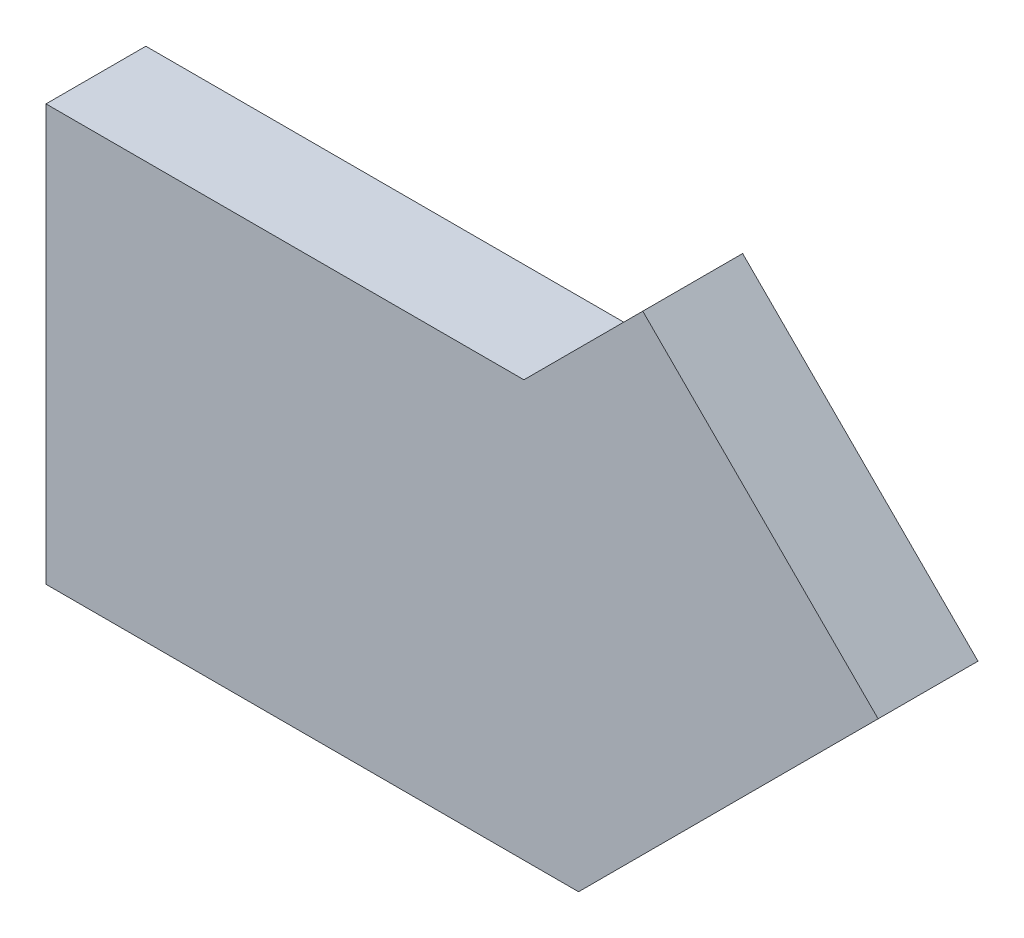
ISO-10303-21;
HEADER;
FILE_DESCRIPTION(('STEP AP214'),'2;1');
FILE_NAME('part.step','',(''),(''),'','','');
FILE_SCHEMA(('AUTOMOTIVE_DESIGN { 1 0 10303 214 1 1 1 1 }'));
ENDSEC;
DATA;
#1=APPLICATION_CONTEXT('core data for automotive mechanical design processes');
#2=APPLICATION_PROTOCOL_DEFINITION('international standard','automotive_design',2000,#1);
#3=PRODUCT_CONTEXT('',#1,'mechanical');
#4=PRODUCT('Part','Part','',(#3));
#5=PRODUCT_RELATED_PRODUCT_CATEGORY('part','',(#4));
#6=PRODUCT_DEFINITION_FORMATION('','',#4);
#7=PRODUCT_DEFINITION_CONTEXT('part definition',#1,'design');
#8=PRODUCT_DEFINITION('design','',#6,#7);
#9=PRODUCT_DEFINITION_SHAPE('','',#8);
#10=(LENGTH_UNIT() NAMED_UNIT(*) SI_UNIT(.MILLI.,.METRE.));
#11=(NAMED_UNIT(*) PLANE_ANGLE_UNIT() SI_UNIT($,.RADIAN.));
#12=(NAMED_UNIT(*) SI_UNIT($,.STERADIAN.) SOLID_ANGLE_UNIT());
#13=UNCERTAINTY_MEASURE_WITH_UNIT(LENGTH_MEASURE(1.E-05),#10,'distance_accuracy_value','');
#14=(GEOMETRIC_REPRESENTATION_CONTEXT(3) GLOBAL_UNCERTAINTY_ASSIGNED_CONTEXT((#13)) GLOBAL_UNIT_ASSIGNED_CONTEXT((#10,
#11,#12)) REPRESENTATION_CONTEXT('',''));
#15=CARTESIAN_POINT('',(0.,0.,0.));
#16=DIRECTION('',(0.,0.,1.));
#17=DIRECTION('',(1.,0.,0.));
#18=AXIS2_PLACEMENT_3D('',#15,#16,#17);
#19=CARTESIAN_POINT('',(0.,25.,6.));
#20=DIRECTION('',(1.,0.,0.));
#21=DIRECTION('',(0.,1.,0.));
#22=AXIS2_PLACEMENT_3D('',#19,#20,#21);
#23=PLANE('',#22);
#24=DIRECTION('',(0.,-1.,0.));
#25=VECTOR('',#24,1.);
#26=CARTESIAN_POINT('',(0.,25.,0.));
#27=LINE('',#26,#25);
#28=CARTESIAN_POINT('',(0.,25.,0.));
#29=VERTEX_POINT('',#28);
#30=CARTESIAN_POINT('',(0.,0.,0.));
#31=VERTEX_POINT('',#30);
#32=EDGE_CURVE('E124',#29,#31,#27,.T.);
#33=ORIENTED_EDGE('',*,*,#32,.T.);
#34=DIRECTION('',(0.,0.,-1.));
#35=VECTOR('',#34,1.);
#36=CARTESIAN_POINT('',(0.,0.,6.));
#37=LINE('',#36,#35);
#38=CARTESIAN_POINT('',(0.,0.,6.));
#39=VERTEX_POINT('',#38);
#40=EDGE_CURVE('E11',#39,#31,#37,.T.);
#41=ORIENTED_EDGE('',*,*,#40,.F.);
#42=DIRECTION('',(0.,-1.,0.));
#43=VECTOR('',#42,1.);
#44=CARTESIAN_POINT('',(0.,25.,6.));
#45=LINE('',#44,#43);
#46=CARTESIAN_POINT('',(0.,25.,6.));
#47=VERTEX_POINT('',#46);
#48=EDGE_CURVE('E131',#47,#39,#45,.T.);
#49=ORIENTED_EDGE('',*,*,#48,.F.);
#50=DIRECTION('',(0.,0.,-1.));
#51=VECTOR('',#50,1.);
#52=CARTESIAN_POINT('',(0.,25.,6.));
#53=LINE('',#52,#51);
#54=EDGE_CURVE('E116',#47,#29,#53,.T.);
#55=ORIENTED_EDGE('',*,*,#54,.T.);
#56=EDGE_LOOP('',(#33,#41,#49,#55));
#57=FACE_BOUND('',#56,.T.);
#58=ADVANCED_FACE('F39',(#57),#23,.F.);
#59=CARTESIAN_POINT('',(0.,0.,6.));
#60=DIRECTION('',(0.,1.,0.));
#61=DIRECTION('',(0.,0.,1.));
#62=AXIS2_PLACEMENT_3D('',#59,#60,#61);
#63=PLANE('',#62);
#64=DIRECTION('',(1.,0.,0.));
#65=VECTOR('',#64,1.);
#66=CARTESIAN_POINT('',(0.,0.,0.));
#67=LINE('',#66,#65);
#68=CARTESIAN_POINT('',(32.,0.,0.));
#69=VERTEX_POINT('',#68);
#70=EDGE_CURVE('E127',#31,#69,#67,.T.);
#71=ORIENTED_EDGE('',*,*,#70,.T.);
#72=DIRECTION('',(0.,0.,-1.));
#73=VECTOR('',#72,1.);
#74=CARTESIAN_POINT('',(32.,0.,6.));
#75=LINE('',#74,#73);
#76=CARTESIAN_POINT('',(32.,0.,6.));
#77=VERTEX_POINT('',#76);
#78=EDGE_CURVE('E50',#77,#69,#75,.T.);
#79=ORIENTED_EDGE('',*,*,#78,.F.);
#80=DIRECTION('',(1.,0.,0.));
#81=VECTOR('',#80,1.);
#82=CARTESIAN_POINT('',(0.,0.,6.));
#83=LINE('',#82,#81);
#84=EDGE_CURVE('E95',#39,#77,#83,.T.);
#85=ORIENTED_EDGE('',*,*,#84,.F.);
#86=ORIENTED_EDGE('',*,*,#40,.T.);
#87=EDGE_LOOP('',(#71,#79,#85,#86));
#88=FACE_BOUND('',#87,.T.);
#89=ADVANCED_FACE('F160',(#88),#63,.F.);
#90=CARTESIAN_POINT('',(32.,0.,6.));
#91=DIRECTION('',(-0.707106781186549,0.707106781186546,0.));
#92=DIRECTION('',(-0.707106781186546,-0.707106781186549,0.));
#93=AXIS2_PLACEMENT_3D('',#90,#91,#92);
#94=PLANE('',#93);
#95=DIRECTION('',(0.707106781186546,0.707106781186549,0.));
#96=VECTOR('',#95,1.);
#97=CARTESIAN_POINT('',(32.,0.,0.));
#98=LINE('',#97,#96);
#99=CARTESIAN_POINT('',(50.,18.0000000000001,0.));
#100=VERTEX_POINT('',#99);
#101=EDGE_CURVE('E126',#69,#100,#98,.T.);
#102=ORIENTED_EDGE('',*,*,#101,.T.);
#103=DIRECTION('',(0.,0.,-1.));
#104=VECTOR('',#103,1.);
#105=CARTESIAN_POINT('',(50.,18.0000000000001,6.));
#106=LINE('',#105,#104);
#107=CARTESIAN_POINT('',(50.,18.0000000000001,6.));
#108=VERTEX_POINT('',#107);
#109=EDGE_CURVE('E111',#108,#100,#106,.T.);
#110=ORIENTED_EDGE('',*,*,#109,.F.);
#111=DIRECTION('',(0.707106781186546,0.707106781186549,0.));
#112=VECTOR('',#111,1.);
#113=CARTESIAN_POINT('',(32.,0.,6.));
#114=LINE('',#113,#112);
#115=EDGE_CURVE('E104',#77,#108,#114,.T.);
#116=ORIENTED_EDGE('',*,*,#115,.F.);
#117=ORIENTED_EDGE('',*,*,#78,.T.);
#118=EDGE_LOOP('',(#102,#110,#116,#117));
#119=FACE_BOUND('',#118,.T.);
#120=ADVANCED_FACE('F137',(#119),#94,.F.);
#121=CARTESIAN_POINT('',(50.,18.0000000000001,6.));
#122=DIRECTION('',(-0.707106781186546,-0.707106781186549,0.));
#123=DIRECTION('',(0.707106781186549,-0.707106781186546,0.));
#124=AXIS2_PLACEMENT_3D('',#121,#122,#123);
#125=PLANE('',#124);
#126=DIRECTION('',(-0.707106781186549,0.707106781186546,0.));
#127=VECTOR('',#126,1.);
#128=CARTESIAN_POINT('',(50.,18.0000000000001,0.));
#129=LINE('',#128,#127);
#130=CARTESIAN_POINT('',(35.857864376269,32.142135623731,0.));
#131=VERTEX_POINT('',#130);
#132=EDGE_CURVE('E114',#100,#131,#129,.T.);
#133=ORIENTED_EDGE('',*,*,#132,.T.);
#134=DIRECTION('',(0.,0.,-1.));
#135=VECTOR('',#134,1.);
#136=CARTESIAN_POINT('',(35.857864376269,32.142135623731,6.));
#137=LINE('',#136,#135);
#138=CARTESIAN_POINT('',(35.857864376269,32.142135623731,6.));
#139=VERTEX_POINT('',#138);
#140=EDGE_CURVE('E109',#139,#131,#137,.T.);
#141=ORIENTED_EDGE('',*,*,#140,.F.);
#142=DIRECTION('',(-0.707106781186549,0.707106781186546,0.));
#143=VECTOR('',#142,1.);
#144=CARTESIAN_POINT('',(50.,18.0000000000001,6.));
#145=LINE('',#144,#143);
#146=EDGE_CURVE('E97',#108,#139,#145,.T.);
#147=ORIENTED_EDGE('',*,*,#146,.F.);
#148=ORIENTED_EDGE('',*,*,#109,.T.);
#149=EDGE_LOOP('',(#133,#141,#147,#148));
#150=FACE_BOUND('',#149,.T.);
#151=ADVANCED_FACE('F112',(#150),#125,.F.);
#152=CARTESIAN_POINT('',(35.857864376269,32.142135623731,6.));
#153=DIRECTION('',(0.707106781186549,-0.707106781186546,0.));
#154=DIRECTION('',(0.707106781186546,0.707106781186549,0.));
#155=AXIS2_PLACEMENT_3D('',#152,#153,#154);
#156=PLANE('',#155);
#157=DIRECTION('',(-0.707106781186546,-0.707106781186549,0.));
#158=VECTOR('',#157,1.);
#159=CARTESIAN_POINT('',(35.857864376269,32.142135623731,0.));
#160=LINE('',#159,#158);
#161=CARTESIAN_POINT('',(28.7157287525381,25.,0.));
#162=VERTEX_POINT('',#161);
#163=EDGE_CURVE('E76',#131,#162,#160,.T.);
#164=ORIENTED_EDGE('',*,*,#163,.T.);
#165=DIRECTION('',(0.,0.,-1.));
#166=VECTOR('',#165,1.);
#167=CARTESIAN_POINT('',(28.7157287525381,25.,6.));
#168=LINE('',#167,#166);
#169=CARTESIAN_POINT('',(28.7157287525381,25.,6.));
#170=VERTEX_POINT('',#169);
#171=EDGE_CURVE('E113',#170,#162,#168,.T.);
#172=ORIENTED_EDGE('',*,*,#171,.F.);
#173=DIRECTION('',(-0.707106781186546,-0.707106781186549,0.));
#174=VECTOR('',#173,1.);
#175=CARTESIAN_POINT('',(35.857864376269,32.142135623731,6.));
#176=LINE('',#175,#174);
#177=EDGE_CURVE('E103',#139,#170,#176,.T.);
#178=ORIENTED_EDGE('',*,*,#177,.F.);
#179=ORIENTED_EDGE('',*,*,#140,.T.);
#180=EDGE_LOOP('',(#164,#172,#178,#179));
#181=FACE_BOUND('',#180,.T.);
#182=ADVANCED_FACE('F119',(#181),#156,.F.);
#183=CARTESIAN_POINT('',(28.7157287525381,25.,6.));
#184=DIRECTION('',(0.,-1.,0.));
#185=DIRECTION('',(1.,0.,0.));
#186=AXIS2_PLACEMENT_3D('',#183,#184,#185);
#187=PLANE('',#186);
#188=DIRECTION('',(-1.,0.,0.));
#189=VECTOR('',#188,1.);
#190=CARTESIAN_POINT('',(28.7157287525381,25.,0.));
#191=LINE('',#190,#189);
#192=EDGE_CURVE('E82',#162,#29,#191,.T.);
#193=ORIENTED_EDGE('',*,*,#192,.T.);
#194=ORIENTED_EDGE('',*,*,#54,.F.);
#195=DIRECTION('',(-1.,0.,0.));
#196=VECTOR('',#195,1.);
#197=CARTESIAN_POINT('',(28.7157287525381,25.,6.));
#198=LINE('',#197,#196);
#199=EDGE_CURVE('E54',#170,#47,#198,.T.);
#200=ORIENTED_EDGE('',*,*,#199,.F.);
#201=ORIENTED_EDGE('',*,*,#171,.T.);
#202=EDGE_LOOP('',(#193,#194,#200,#201));
#203=FACE_BOUND('',#202,.T.);
#204=ADVANCED_FACE('F148',(#203),#187,.F.);
#205=CARTESIAN_POINT('',(0.,0.,6.));
#206=DIRECTION('',(0.,0.,1.));
#207=DIRECTION('',(1.,0.,0.));
#208=AXIS2_PLACEMENT_3D('',#205,#206,#207);
#209=PLANE('',#208);
#210=ORIENTED_EDGE('',*,*,#48,.T.);
#211=ORIENTED_EDGE('',*,*,#84,.T.);
#212=ORIENTED_EDGE('',*,*,#115,.T.);
#213=ORIENTED_EDGE('',*,*,#146,.T.);
#214=ORIENTED_EDGE('',*,*,#177,.T.);
#215=ORIENTED_EDGE('',*,*,#199,.T.);
#216=EDGE_LOOP('',(#210,#211,#212,#213,#214,#215));
#217=FACE_BOUND('',#216,.T.);
#218=ADVANCED_FACE('F101',(#217),#209,.T.);
#219=CARTESIAN_POINT('',(0.,0.,0.));
#220=DIRECTION('',(0.,0.,1.));
#221=DIRECTION('',(1.,0.,0.));
#222=AXIS2_PLACEMENT_3D('',#219,#220,#221);
#223=PLANE('',#222);
#224=ORIENTED_EDGE('',*,*,#32,.F.);
#225=ORIENTED_EDGE('',*,*,#192,.F.);
#226=ORIENTED_EDGE('',*,*,#163,.F.);
#227=ORIENTED_EDGE('',*,*,#132,.F.);
#228=ORIENTED_EDGE('',*,*,#101,.F.);
#229=ORIENTED_EDGE('',*,*,#70,.F.);
#230=EDGE_LOOP('',(#224,#225,#226,#227,#228,#229));
#231=FACE_BOUND('',#230,.T.);
#232=ADVANCED_FACE('F142',(#231),#223,.F.);
#233=CLOSED_SHELL('',(#58,#89,#120,#151,#182,#204,#218,#232));
#234=MANIFOLD_SOLID_BREP('B2',#233);
#235=ADVANCED_BREP_SHAPE_REPRESENTATION('',(#18,#234),#14);
#236=SHAPE_DEFINITION_REPRESENTATION(#9,#235);
ENDSEC;
END-ISO-10303-21;
